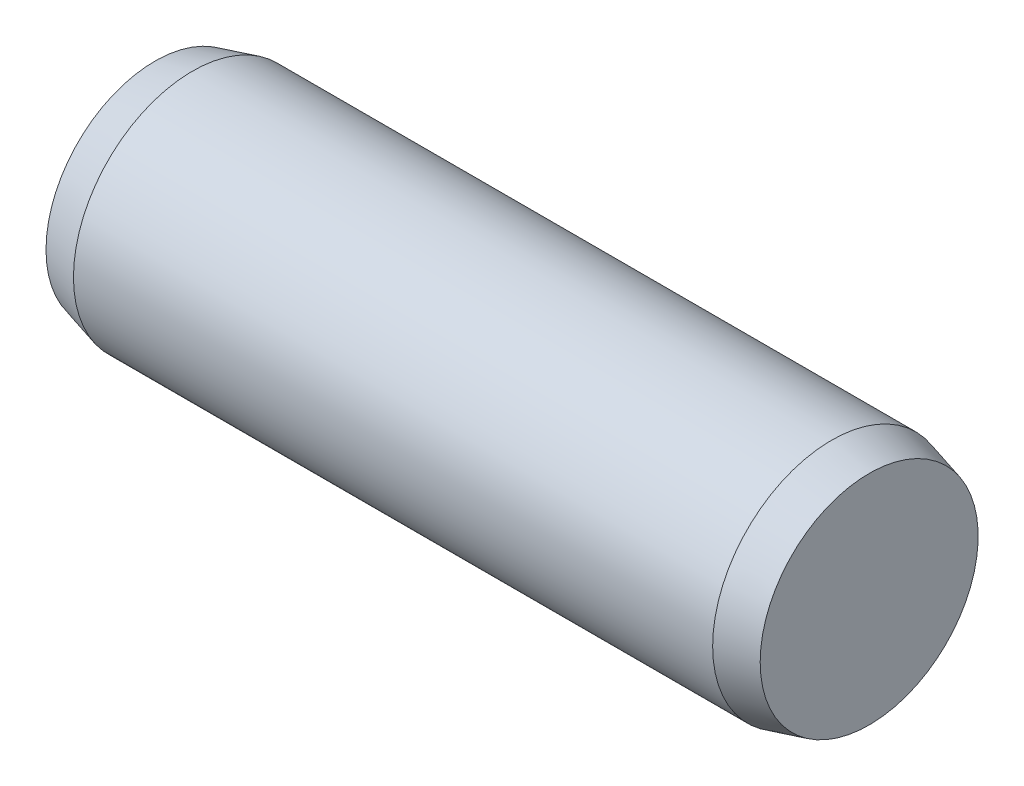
ISO-10303-21;
HEADER;
FILE_DESCRIPTION(('STEP AP214'),'2;1');
FILE_NAME('part.step','',(''),(''),'','','');
FILE_SCHEMA(('AUTOMOTIVE_DESIGN { 1 0 10303 214 1 1 1 1 }'));
ENDSEC;
DATA;
#1=APPLICATION_CONTEXT('core data for automotive mechanical design processes');
#2=APPLICATION_PROTOCOL_DEFINITION('international standard','automotive_design',2000,#1);
#3=PRODUCT_CONTEXT('',#1,'mechanical');
#4=PRODUCT('Part','Part','',(#3));
#5=PRODUCT_RELATED_PRODUCT_CATEGORY('part','',(#4));
#6=PRODUCT_DEFINITION_FORMATION('','',#4);
#7=PRODUCT_DEFINITION_CONTEXT('part definition',#1,'design');
#8=PRODUCT_DEFINITION('design','',#6,#7);
#9=PRODUCT_DEFINITION_SHAPE('','',#8);
#10=(LENGTH_UNIT() NAMED_UNIT(*) SI_UNIT(.MILLI.,.METRE.));
#11=(NAMED_UNIT(*) PLANE_ANGLE_UNIT() SI_UNIT($,.RADIAN.));
#12=(NAMED_UNIT(*) SI_UNIT($,.STERADIAN.) SOLID_ANGLE_UNIT());
#13=UNCERTAINTY_MEASURE_WITH_UNIT(LENGTH_MEASURE(1.E-05),#10,'distance_accuracy_value','');
#14=(GEOMETRIC_REPRESENTATION_CONTEXT(3) GLOBAL_UNCERTAINTY_ASSIGNED_CONTEXT((#13)) GLOBAL_UNIT_ASSIGNED_CONTEXT((#10,
#11,#12)) REPRESENTATION_CONTEXT('',''));
#15=CARTESIAN_POINT('',(0.,0.,0.));
#16=DIRECTION('',(0.,0.,1.));
#17=DIRECTION('',(1.,0.,0.));
#18=AXIS2_PLACEMENT_3D('',#15,#16,#17);
#19=CARTESIAN_POINT('',(0.,1.83119200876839,0.));
#20=DIRECTION('',(1.,0.,0.));
#21=DIRECTION('',(0.,0.,-1.));
#22=AXIS2_PLACEMENT_3D('',#19,#20,#21);
#23=PLANE('',#22);
#24=CARTESIAN_POINT('',(0.,0.,0.));
#25=DIRECTION('',(-1.,0.,0.));
#26=DIRECTION('',(0.,0.,1.));
#27=AXIS2_PLACEMENT_3D('',#24,#25,#26);
#28=CIRCLE('',#27,1.83119200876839);
#29=CARTESIAN_POINT('',(0.,0.,1.83119200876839));
#30=VERTEX_POINT('',#29);
#31=EDGE_CURVE('E48',#30,#30,#28,.T.);
#32=ORIENTED_EDGE('',*,*,#31,.T.);
#33=EDGE_LOOP('',(#32));
#34=FACE_BOUND('',#33,.T.);
#35=ADVANCED_FACE('F34',(#34),#23,.F.);
#36=CARTESIAN_POINT('',(12.,0.,0.));
#37=DIRECTION('',(-1.,0.,0.));
#38=DIRECTION('',(0.,0.,1.));
#39=AXIS2_PLACEMENT_3D('',#36,#37,#38);
#40=PLANE('',#39);
#41=CARTESIAN_POINT('',(12.,0.,0.));
#42=DIRECTION('',(-1.,0.,0.));
#43=DIRECTION('',(0.,0.,1.));
#44=AXIS2_PLACEMENT_3D('',#41,#42,#43);
#45=CIRCLE('',#44,1.83119200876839);
#46=CARTESIAN_POINT('',(12.,0.,1.83119200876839));
#47=VERTEX_POINT('',#46);
#48=EDGE_CURVE('E10',#47,#47,#45,.T.);
#49=ORIENTED_EDGE('',*,*,#48,.F.);
#50=EDGE_LOOP('',(#49));
#51=FACE_BOUND('',#50,.T.);
#52=ADVANCED_FACE('F68',(#51),#40,.F.);
#53=CARTESIAN_POINT('',(12.,0.,0.));
#54=DIRECTION('',(-1.,0.,0.));
#55=DIRECTION('',(0.,0.,1.));
#56=AXIS2_PLACEMENT_3D('',#53,#54,#55);
#57=CONICAL_SURFACE('',#56,1.83119200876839,0.26179938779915);
#58=CARTESIAN_POINT('',(11.37,0.,0.));
#59=DIRECTION('',(-1.,0.,0.));
#60=DIRECTION('',(0.,0.,1.));
#61=AXIS2_PLACEMENT_3D('',#58,#59,#60);
#62=CIRCLE('',#61,1.99999999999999);
#63=CARTESIAN_POINT('',(11.37,0.,1.99999999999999));
#64=VERTEX_POINT('',#63);
#65=EDGE_CURVE('E40',#64,#64,#62,.T.);
#66=ORIENTED_EDGE('',*,*,#65,.F.);
#67=EDGE_LOOP('',(#66));
#68=FACE_BOUND('',#67,.T.);
#69=ORIENTED_EDGE('',*,*,#48,.T.);
#70=EDGE_LOOP('',(#69));
#71=FACE_BOUND('',#70,.T.);
#72=ADVANCED_FACE('F63',(#68,#71),#57,.T.);
#73=CARTESIAN_POINT('',(-6.35,0.,0.));
#74=DIRECTION('',(-1.,0.,0.));
#75=DIRECTION('',(0.,0.,1.));
#76=AXIS2_PLACEMENT_3D('',#73,#74,#75);
#77=CYLINDRICAL_SURFACE('',#76,1.99999999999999);
#78=CARTESIAN_POINT('',(0.63,0.,0.));
#79=DIRECTION('',(-1.,0.,0.));
#80=DIRECTION('',(0.,0.,1.));
#81=AXIS2_PLACEMENT_3D('',#78,#79,#80);
#82=CIRCLE('',#81,1.99999999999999);
#83=CARTESIAN_POINT('',(0.63,0.,1.99999999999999));
#84=VERTEX_POINT('',#83);
#85=EDGE_CURVE('E44',#84,#84,#82,.T.);
#86=ORIENTED_EDGE('',*,*,#85,.F.);
#87=EDGE_LOOP('',(#86));
#88=FACE_BOUND('',#87,.T.);
#89=ORIENTED_EDGE('',*,*,#65,.T.);
#90=EDGE_LOOP('',(#89));
#91=FACE_BOUND('',#90,.T.);
#92=ADVANCED_FACE('F58',(#88,#91),#77,.T.);
#93=CARTESIAN_POINT('',(0.63,0.,0.));
#94=DIRECTION('',(1.,0.,0.));
#95=DIRECTION('',(0.,0.,-1.));
#96=AXIS2_PLACEMENT_3D('',#93,#94,#95);
#97=CONICAL_SURFACE('',#96,1.99999999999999,0.261799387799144);
#98=ORIENTED_EDGE('',*,*,#31,.F.);
#99=EDGE_LOOP('',(#98));
#100=FACE_BOUND('',#99,.T.);
#101=ORIENTED_EDGE('',*,*,#85,.T.);
#102=EDGE_LOOP('',(#101));
#103=FACE_BOUND('',#102,.T.);
#104=ADVANCED_FACE('F55',(#100,#103),#97,.T.);
#105=CLOSED_SHELL('',(#35,#52,#72,#92,#104));
#106=MANIFOLD_SOLID_BREP('B2',#105);
#107=ADVANCED_BREP_SHAPE_REPRESENTATION('',(#18,#106),#14);
#108=SHAPE_DEFINITION_REPRESENTATION(#9,#107);
ENDSEC;
END-ISO-10303-21;
